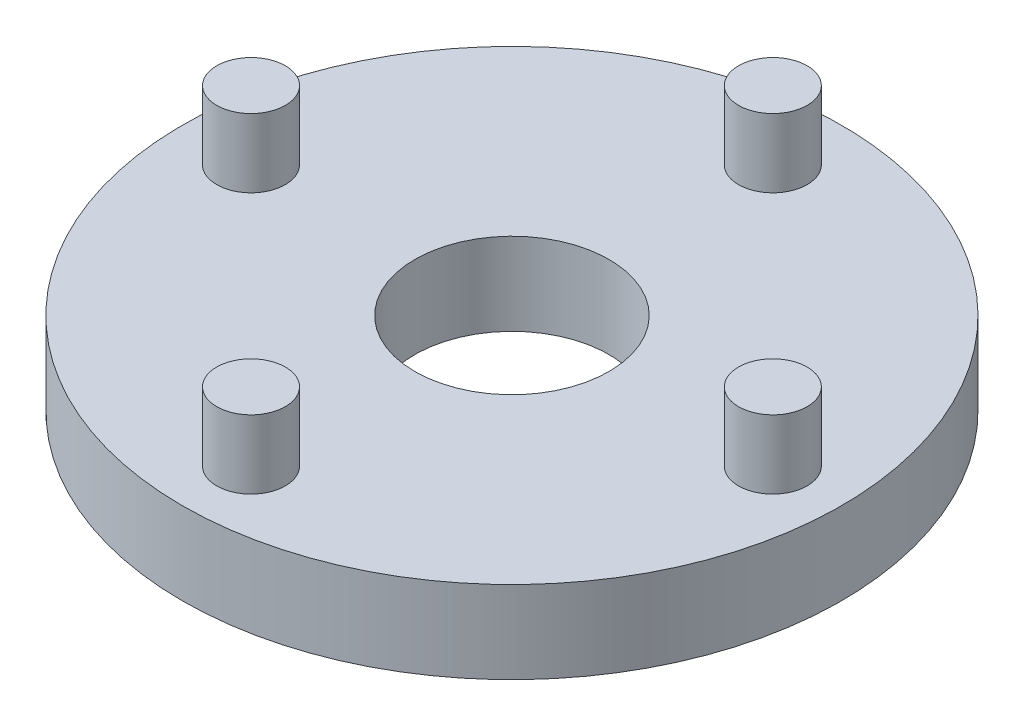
ISO-10303-21;
HEADER;
FILE_DESCRIPTION(('STEP AP214'),'2;1');
FILE_NAME('part.step','',(''),(''),'','','');
FILE_SCHEMA(('AUTOMOTIVE_DESIGN { 1 0 10303 214 1 1 1 1 }'));
ENDSEC;
DATA;
#1=APPLICATION_CONTEXT('core data for automotive mechanical design processes');
#2=APPLICATION_PROTOCOL_DEFINITION('international standard','automotive_design',2000,#1);
#3=PRODUCT_CONTEXT('',#1,'mechanical');
#4=PRODUCT('Part','Part','',(#3));
#5=PRODUCT_RELATED_PRODUCT_CATEGORY('part','',(#4));
#6=PRODUCT_DEFINITION_FORMATION('','',#4);
#7=PRODUCT_DEFINITION_CONTEXT('part definition',#1,'design');
#8=PRODUCT_DEFINITION('design','',#6,#7);
#9=PRODUCT_DEFINITION_SHAPE('','',#8);
#10=(LENGTH_UNIT() NAMED_UNIT(*) SI_UNIT(.MILLI.,.METRE.));
#11=(NAMED_UNIT(*) PLANE_ANGLE_UNIT() SI_UNIT($,.RADIAN.));
#12=(NAMED_UNIT(*) SI_UNIT($,.STERADIAN.) SOLID_ANGLE_UNIT());
#13=UNCERTAINTY_MEASURE_WITH_UNIT(LENGTH_MEASURE(1.E-05),#10,'distance_accuracy_value','');
#14=(GEOMETRIC_REPRESENTATION_CONTEXT(3) GLOBAL_UNCERTAINTY_ASSIGNED_CONTEXT((#13)) GLOBAL_UNIT_ASSIGNED_CONTEXT((#10,
#11,#12)) REPRESENTATION_CONTEXT('',''));
#15=CARTESIAN_POINT('',(0.,0.,0.));
#16=DIRECTION('',(0.,0.,1.));
#17=DIRECTION('',(1.,0.,0.));
#18=AXIS2_PLACEMENT_3D('',#15,#16,#17);
#19=CARTESIAN_POINT('',(0.,0.,0.));
#20=DIRECTION('',(0.,1.,0.));
#21=DIRECTION('',(0.,0.,1.));
#22=AXIS2_PLACEMENT_3D('',#19,#20,#21);
#23=PLANE('',#22);
#24=CARTESIAN_POINT('',(0.,0.,0.));
#25=DIRECTION('',(0.,1.,0.));
#26=DIRECTION('',(0.,0.,1.));
#27=AXIS2_PLACEMENT_3D('',#24,#25,#26);
#28=CIRCLE('',#27,7.07106781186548);
#29=CARTESIAN_POINT('',(0.,0.,7.07106781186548));
#30=VERTEX_POINT('',#29);
#31=EDGE_CURVE('E44',#30,#30,#28,.T.);
#32=ORIENTED_EDGE('',*,*,#31,.T.);
#33=EDGE_LOOP('',(#32));
#34=FACE_BOUND('',#33,.T.);
#35=CARTESIAN_POINT('',(0.,0.,0.));
#36=DIRECTION('',(0.,-1.,0.));
#37=DIRECTION('',(0.,0.,-1.));
#38=AXIS2_PLACEMENT_3D('',#35,#36,#37);
#39=CIRCLE('',#38,10.5);
#40=CARTESIAN_POINT('',(0.,0.,-10.5));
#41=VERTEX_POINT('',#40);
#42=EDGE_CURVE('E82',#41,#41,#39,.T.);
#43=ORIENTED_EDGE('',*,*,#42,.T.);
#44=EDGE_LOOP('',(#43));
#45=FACE_BOUND('',#44,.T.);
#46=ADVANCED_FACE('F33',(#34,#45),#23,.F.);
#47=CARTESIAN_POINT('',(0.,6.,0.));
#48=DIRECTION('',(0.,-1.,0.));
#49=DIRECTION('',(0.,0.,-1.));
#50=AXIS2_PLACEMENT_3D('',#47,#48,#49);
#51=CYLINDRICAL_SURFACE('',#50,24.);
#52=CARTESIAN_POINT('',(0.,6.,0.));
#53=DIRECTION('',(0.,1.,0.));
#54=DIRECTION('',(0.,0.,1.));
#55=AXIS2_PLACEMENT_3D('',#52,#53,#54);
#56=CIRCLE('',#55,24.);
#57=CARTESIAN_POINT('',(0.,6.,24.));
#58=VERTEX_POINT('',#57);
#59=EDGE_CURVE('E10',#58,#58,#56,.T.);
#60=ORIENTED_EDGE('',*,*,#59,.F.);
#61=EDGE_LOOP('',(#60));
#62=FACE_BOUND('',#61,.T.);
#63=CARTESIAN_POINT('',(0.,0.,0.));
#64=DIRECTION('',(0.,1.,0.));
#65=DIRECTION('',(0.,0.,1.));
#66=AXIS2_PLACEMENT_3D('',#63,#64,#65);
#67=CIRCLE('',#66,24.);
#68=CARTESIAN_POINT('',(0.,0.,24.));
#69=VERTEX_POINT('',#68);
#70=EDGE_CURVE('E37',#69,#69,#67,.T.);
#71=ORIENTED_EDGE('',*,*,#70,.T.);
#72=EDGE_LOOP('',(#71));
#73=FACE_BOUND('',#72,.T.);
#74=ADVANCED_FACE('F35',(#62,#73),#51,.T.);
#75=CARTESIAN_POINT('',(0.,6.,0.));
#76=DIRECTION('',(0.,1.,0.));
#77=DIRECTION('',(0.,0.,1.));
#78=AXIS2_PLACEMENT_3D('',#75,#76,#77);
#79=PLANE('',#78);
#80=CARTESIAN_POINT('',(-1.99014436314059E-13,6.,19.));
#81=DIRECTION('',(0.,1.,0.));
#82=DIRECTION('',(0.,0.,1.));
#83=AXIS2_PLACEMENT_3D('',#80,#81,#82);
#84=CIRCLE('',#83,2.5);
#85=CARTESIAN_POINT('',(-1.99014436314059E-13,6.,21.5));
#86=VERTEX_POINT('',#85);
#87=EDGE_CURVE('E70',#86,#86,#84,.T.);
#88=ORIENTED_EDGE('',*,*,#87,.F.);
#89=EDGE_LOOP('',(#88));
#90=FACE_BOUND('',#89,.T.);
#91=CARTESIAN_POINT('',(19.,6.,1.32676290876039E-13));
#92=DIRECTION('',(0.,1.,0.));
#93=DIRECTION('',(0.,0.,1.));
#94=AXIS2_PLACEMENT_3D('',#91,#92,#93);
#95=CIRCLE('',#94,2.5);
#96=CARTESIAN_POINT('',(19.,6.,2.50000000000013));
#97=VERTEX_POINT('',#96);
#98=EDGE_CURVE('E64',#97,#97,#95,.T.);
#99=ORIENTED_EDGE('',*,*,#98,.F.);
#100=EDGE_LOOP('',(#99));
#101=FACE_BOUND('',#100,.T.);
#102=CARTESIAN_POINT('',(0.,6.,-19.));
#103=DIRECTION('',(0.,1.,0.));
#104=DIRECTION('',(0.,0.,1.));
#105=AXIS2_PLACEMENT_3D('',#102,#103,#104);
#106=CIRCLE('',#105,2.5);
#107=CARTESIAN_POINT('',(0.,6.,-16.5));
#108=VERTEX_POINT('',#107);
#109=EDGE_CURVE('E58',#108,#108,#106,.T.);
#110=ORIENTED_EDGE('',*,*,#109,.F.);
#111=EDGE_LOOP('',(#110));
#112=FACE_BOUND('',#111,.T.);
#113=CARTESIAN_POINT('',(-19.,6.,0.));
#114=DIRECTION('',(0.,1.,0.));
#115=DIRECTION('',(0.,0.,1.));
#116=AXIS2_PLACEMENT_3D('',#113,#114,#115);
#117=CIRCLE('',#116,2.5);
#118=CARTESIAN_POINT('',(-19.,6.,2.5));
#119=VERTEX_POINT('',#118);
#120=EDGE_CURVE('E52',#119,#119,#117,.T.);
#121=ORIENTED_EDGE('',*,*,#120,.F.);
#122=EDGE_LOOP('',(#121));
#123=FACE_BOUND('',#122,.T.);
#124=CARTESIAN_POINT('',(0.,6.,0.));
#125=DIRECTION('',(0.,1.,0.));
#126=DIRECTION('',(0.,0.,1.));
#127=AXIS2_PLACEMENT_3D('',#124,#125,#126);
#128=CIRCLE('',#127,7.07106781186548);
#129=CARTESIAN_POINT('',(0.,6.,7.07106781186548));
#130=VERTEX_POINT('',#129);
#131=EDGE_CURVE('E46',#130,#130,#128,.T.);
#132=ORIENTED_EDGE('',*,*,#131,.F.);
#133=EDGE_LOOP('',(#132));
#134=FACE_BOUND('',#133,.T.);
#135=ORIENTED_EDGE('',*,*,#59,.T.);
#136=EDGE_LOOP('',(#135));
#137=FACE_BOUND('',#136,.T.);
#138=ADVANCED_FACE('F108',(#90,#101,#112,#123,#134,#137),#79,.T.);
#139=CARTESIAN_POINT('',(0.,0.,0.));
#140=DIRECTION('',(0.,-1.,0.));
#141=DIRECTION('',(0.,0.,-1.));
#142=AXIS2_PLACEMENT_3D('',#139,#140,#141);
#143=CIRCLE('',#142,21.);
#144=CARTESIAN_POINT('',(0.,0.,-21.));
#145=VERTEX_POINT('',#144);
#146=EDGE_CURVE('E76',#145,#145,#143,.T.);
#147=ORIENTED_EDGE('',*,*,#146,.F.);
#148=EDGE_LOOP('',(#147));
#149=FACE_BOUND('',#148,.T.);
#150=ORIENTED_EDGE('',*,*,#70,.F.);
#151=EDGE_LOOP('',(#150));
#152=FACE_BOUND('',#151,.T.);
#153=ADVANCED_FACE('F104',(#149,#152),#23,.F.);
#154=CARTESIAN_POINT('',(0.,0.,0.));
#155=DIRECTION('',(0.,1.,0.));
#156=DIRECTION('',(0.,0.,1.));
#157=AXIS2_PLACEMENT_3D('',#154,#155,#156);
#158=CYLINDRICAL_SURFACE('',#157,7.07106781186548);
#159=ORIENTED_EDGE('',*,*,#31,.F.);
#160=EDGE_LOOP('',(#159));
#161=FACE_BOUND('',#160,.T.);
#162=ORIENTED_EDGE('',*,*,#131,.T.);
#163=EDGE_LOOP('',(#162));
#164=FACE_BOUND('',#163,.T.);
#165=ADVANCED_FACE('F107',(#161,#164),#158,.F.);
#166=CARTESIAN_POINT('',(-19.,11.,0.));
#167=DIRECTION('',(0.,-1.,0.));
#168=DIRECTION('',(0.,0.,-1.));
#169=AXIS2_PLACEMENT_3D('',#166,#167,#168);
#170=CYLINDRICAL_SURFACE('',#169,2.5);
#171=CARTESIAN_POINT('',(-19.,11.,0.));
#172=DIRECTION('',(0.,1.,0.));
#173=DIRECTION('',(0.,0.,1.));
#174=AXIS2_PLACEMENT_3D('',#171,#172,#173);
#175=CIRCLE('',#174,2.5);
#176=CARTESIAN_POINT('',(-19.,11.,2.5));
#177=VERTEX_POINT('',#176);
#178=EDGE_CURVE('E49',#177,#177,#175,.T.);
#179=ORIENTED_EDGE('',*,*,#178,.F.);
#180=EDGE_LOOP('',(#179));
#181=FACE_BOUND('',#180,.T.);
#182=ORIENTED_EDGE('',*,*,#120,.T.);
#183=EDGE_LOOP('',(#182));
#184=FACE_BOUND('',#183,.T.);
#185=ADVANCED_FACE('F126',(#181,#184),#170,.T.);
#186=CARTESIAN_POINT('',(-19.,11.,0.));
#187=DIRECTION('',(0.,1.,0.));
#188=DIRECTION('',(0.,0.,1.));
#189=AXIS2_PLACEMENT_3D('',#186,#187,#188);
#190=PLANE('',#189);
#191=ORIENTED_EDGE('',*,*,#178,.T.);
#192=EDGE_LOOP('',(#191));
#193=FACE_BOUND('',#192,.T.);
#194=ADVANCED_FACE('F130',(#193),#190,.T.);
#195=CARTESIAN_POINT('',(0.,11.,-19.));
#196=DIRECTION('',(0.,-1.,0.));
#197=DIRECTION('',(0.,0.,-1.));
#198=AXIS2_PLACEMENT_3D('',#195,#196,#197);
#199=CYLINDRICAL_SURFACE('',#198,2.5);
#200=CARTESIAN_POINT('',(0.,11.,-19.));
#201=DIRECTION('',(0.,1.,0.));
#202=DIRECTION('',(0.,0.,1.));
#203=AXIS2_PLACEMENT_3D('',#200,#201,#202);
#204=CIRCLE('',#203,2.5);
#205=CARTESIAN_POINT('',(0.,11.,-16.5));
#206=VERTEX_POINT('',#205);
#207=EDGE_CURVE('E55',#206,#206,#204,.T.);
#208=ORIENTED_EDGE('',*,*,#207,.F.);
#209=EDGE_LOOP('',(#208));
#210=FACE_BOUND('',#209,.T.);
#211=ORIENTED_EDGE('',*,*,#109,.T.);
#212=EDGE_LOOP('',(#211));
#213=FACE_BOUND('',#212,.T.);
#214=ADVANCED_FACE('F134',(#210,#213),#199,.T.);
#215=CARTESIAN_POINT('',(0.,11.,-19.));
#216=DIRECTION('',(0.,1.,0.));
#217=DIRECTION('',(0.,0.,1.));
#218=AXIS2_PLACEMENT_3D('',#215,#216,#217);
#219=PLANE('',#218);
#220=ORIENTED_EDGE('',*,*,#207,.T.);
#221=EDGE_LOOP('',(#220));
#222=FACE_BOUND('',#221,.T.);
#223=ADVANCED_FACE('F138',(#222),#219,.T.);
#224=CARTESIAN_POINT('',(19.,11.,1.32676290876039E-13));
#225=DIRECTION('',(0.,-1.,0.));
#226=DIRECTION('',(0.,0.,-1.));
#227=AXIS2_PLACEMENT_3D('',#224,#225,#226);
#228=CYLINDRICAL_SURFACE('',#227,2.5);
#229=CARTESIAN_POINT('',(19.,11.,1.32676290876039E-13));
#230=DIRECTION('',(0.,1.,0.));
#231=DIRECTION('',(0.,0.,1.));
#232=AXIS2_PLACEMENT_3D('',#229,#230,#231);
#233=CIRCLE('',#232,2.5);
#234=CARTESIAN_POINT('',(19.,11.,2.50000000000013));
#235=VERTEX_POINT('',#234);
#236=EDGE_CURVE('E61',#235,#235,#233,.T.);
#237=ORIENTED_EDGE('',*,*,#236,.F.);
#238=EDGE_LOOP('',(#237));
#239=FACE_BOUND('',#238,.T.);
#240=ORIENTED_EDGE('',*,*,#98,.T.);
#241=EDGE_LOOP('',(#240));
#242=FACE_BOUND('',#241,.T.);
#243=ADVANCED_FACE('F142',(#239,#242),#228,.T.);
#244=CARTESIAN_POINT('',(19.,11.,1.32676290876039E-13));
#245=DIRECTION('',(0.,1.,0.));
#246=DIRECTION('',(0.,0.,1.));
#247=AXIS2_PLACEMENT_3D('',#244,#245,#246);
#248=PLANE('',#247);
#249=ORIENTED_EDGE('',*,*,#236,.T.);
#250=EDGE_LOOP('',(#249));
#251=FACE_BOUND('',#250,.T.);
#252=ADVANCED_FACE('F146',(#251),#248,.T.);
#253=CARTESIAN_POINT('',(-1.99014436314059E-13,11.,19.));
#254=DIRECTION('',(0.,-1.,0.));
#255=DIRECTION('',(0.,0.,-1.));
#256=AXIS2_PLACEMENT_3D('',#253,#254,#255);
#257=CYLINDRICAL_SURFACE('',#256,2.5);
#258=CARTESIAN_POINT('',(-1.99014436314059E-13,11.,19.));
#259=DIRECTION('',(0.,1.,0.));
#260=DIRECTION('',(0.,0.,1.));
#261=AXIS2_PLACEMENT_3D('',#258,#259,#260);
#262=CIRCLE('',#261,2.5);
#263=CARTESIAN_POINT('',(-1.99014436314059E-13,11.,21.5));
#264=VERTEX_POINT('',#263);
#265=EDGE_CURVE('E67',#264,#264,#262,.T.);
#266=ORIENTED_EDGE('',*,*,#265,.F.);
#267=EDGE_LOOP('',(#266));
#268=FACE_BOUND('',#267,.T.);
#269=ORIENTED_EDGE('',*,*,#87,.T.);
#270=EDGE_LOOP('',(#269));
#271=FACE_BOUND('',#270,.T.);
#272=ADVANCED_FACE('F150',(#268,#271),#257,.T.);
#273=CARTESIAN_POINT('',(-1.99014436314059E-13,11.,19.));
#274=DIRECTION('',(0.,1.,0.));
#275=DIRECTION('',(0.,0.,1.));
#276=AXIS2_PLACEMENT_3D('',#273,#274,#275);
#277=PLANE('',#276);
#278=ORIENTED_EDGE('',*,*,#265,.T.);
#279=EDGE_LOOP('',(#278));
#280=FACE_BOUND('',#279,.T.);
#281=ADVANCED_FACE('F100',(#280),#277,.T.);
#282=CARTESIAN_POINT('',(0.,4.,0.));
#283=DIRECTION('',(0.,-1.,0.));
#284=DIRECTION('',(0.,0.,-1.));
#285=AXIS2_PLACEMENT_3D('',#282,#283,#284);
#286=CYLINDRICAL_SURFACE('',#285,21.);
#287=CARTESIAN_POINT('',(0.,4.,0.));
#288=DIRECTION('',(0.,-1.,0.));
#289=DIRECTION('',(0.,0.,-1.));
#290=AXIS2_PLACEMENT_3D('',#287,#288,#289);
#291=CIRCLE('',#290,21.);
#292=CARTESIAN_POINT('',(0.,4.,-21.));
#293=VERTEX_POINT('',#292);
#294=EDGE_CURVE('E73',#293,#293,#291,.T.);
#295=ORIENTED_EDGE('',*,*,#294,.F.);
#296=EDGE_LOOP('',(#295));
#297=FACE_BOUND('',#296,.T.);
#298=ORIENTED_EDGE('',*,*,#146,.T.);
#299=EDGE_LOOP('',(#298));
#300=FACE_BOUND('',#299,.T.);
#301=ADVANCED_FACE('F94',(#297,#300),#286,.F.);
#302=CARTESIAN_POINT('',(0.,4.,0.));
#303=DIRECTION('',(0.,-1.,0.));
#304=DIRECTION('',(0.,0.,-1.));
#305=AXIS2_PLACEMENT_3D('',#302,#303,#304);
#306=PLANE('',#305);
#307=CARTESIAN_POINT('',(0.,4.,0.));
#308=DIRECTION('',(0.,-1.,0.));
#309=DIRECTION('',(0.,0.,-1.));
#310=AXIS2_PLACEMENT_3D('',#307,#308,#309);
#311=CIRCLE('',#310,10.5);
#312=CARTESIAN_POINT('',(0.,4.,-10.5));
#313=VERTEX_POINT('',#312);
#314=EDGE_CURVE('E79',#313,#313,#311,.T.);
#315=ORIENTED_EDGE('',*,*,#314,.F.);
#316=EDGE_LOOP('',(#315));
#317=FACE_BOUND('',#316,.T.);
#318=ORIENTED_EDGE('',*,*,#294,.T.);
#319=EDGE_LOOP('',(#318));
#320=FACE_BOUND('',#319,.T.);
#321=ADVANCED_FACE('F91',(#317,#320),#306,.T.);
#322=CARTESIAN_POINT('',(0.,4.,0.));
#323=DIRECTION('',(0.,-1.,0.));
#324=DIRECTION('',(0.,0.,-1.));
#325=AXIS2_PLACEMENT_3D('',#322,#323,#324);
#326=CYLINDRICAL_SURFACE('',#325,10.5);
#327=ORIENTED_EDGE('',*,*,#314,.T.);
#328=EDGE_LOOP('',(#327));
#329=FACE_BOUND('',#328,.T.);
#330=ORIENTED_EDGE('',*,*,#42,.F.);
#331=EDGE_LOOP('',(#330));
#332=FACE_BOUND('',#331,.T.);
#333=ADVANCED_FACE('F88',(#329,#332),#326,.T.);
#334=CLOSED_SHELL('',(#46,#74,#138,#153,#165,#185,#194,#214,#223,#243,#252,#272,#281,#301,#321,#333));
#335=MANIFOLD_SOLID_BREP('B2',#334);
#336=ADVANCED_BREP_SHAPE_REPRESENTATION('',(#18,#335),#14);
#337=SHAPE_DEFINITION_REPRESENTATION(#9,#336);
ENDSEC;
END-ISO-10303-21;
